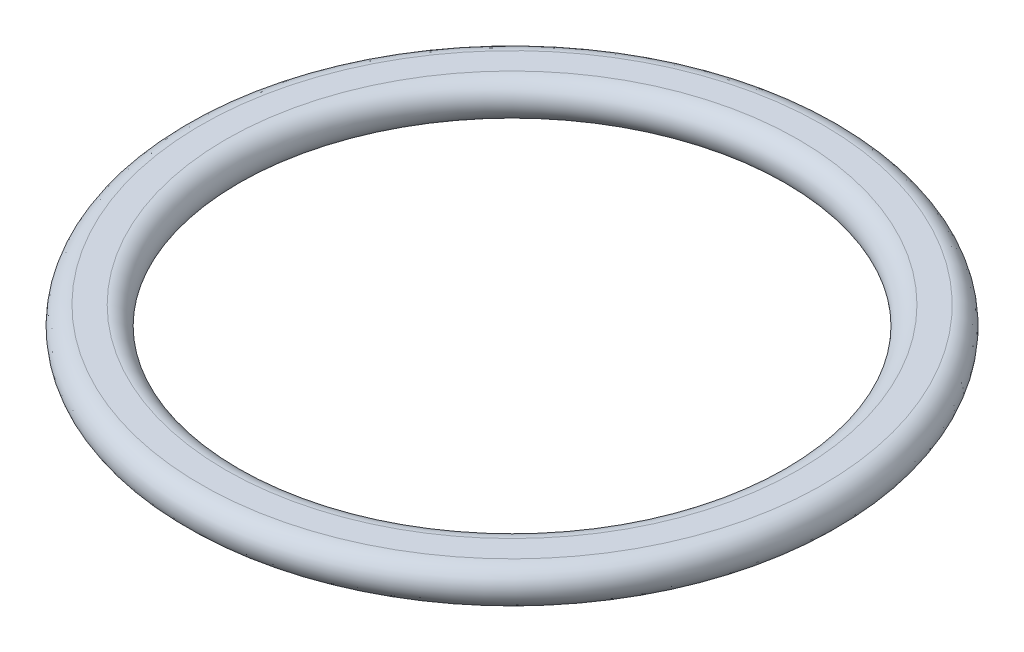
from build123d import *


with BuildPart() as part:
    # Esquisse1 → R_volution1 (revolve)
    with BuildSketch(Plane.XY, mode=Mode.PRIVATE) as r_volution1_sk:
        with BuildLine():
            Line((29.65, -1.9), (32.23, -1.9))
            add(Edge.make_bspline(
                [(32.23, 1.9), (32.442655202, 1.9), (32.658243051, 1.863284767), (32.858910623, 1.792894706), (33.059578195, 1.722504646), (33.250860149, 1.616498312), (33.416916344, 1.483654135), (33.582972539, 1.350809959), (33.728383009, 1.187463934), (33.84110625, 1.007142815), (33.953829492, 0.826821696), (34.036974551, 0.624552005), (34.083656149, 0.417083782), (34.130337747, 0.209615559), (34.14184342, -0.008773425), (34.117220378, -0.219998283), (34.092597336, -0.431223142), (34.031166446, -0.641109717), (33.938014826, -0.832277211), (33.844863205, -1.023444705), (33.717421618, -1.201165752), (33.566243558, -1.350723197), (33.415065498, -1.500280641), (33.235981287, -1.625799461), (33.043820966, -1.716885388), (32.851660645, -1.807971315), (32.641124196, -1.867136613), (32.429646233, -1.889481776), (32.363374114, -1.896484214), (32.296641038, -1.9), (32.23, -1.9)],
                knots=[0, 0, 0, 0, 0.000637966, 0.000637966, 0.000637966, 0.001275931, 0.001275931, 0.001275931, 0.001913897, 0.001913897, 0.001913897, 0.002551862, 0.002551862, 0.002551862, 0.003189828, 0.003189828, 0.003189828, 0.003827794, 0.003827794, 0.003827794, 0.004465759, 0.004465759, 0.004465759, 0.005103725, 0.005103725, 0.005103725, 0.00574169, 0.00574169, 0.00574169, 0.005939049, 0.005939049, 0.005939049, 0.005939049], degree=3))
            Line((32.23, 1.9), (29.65, 1.9))
            ThreePointArc((29.65, 1.9), (27.75, 0), (29.65, -1.9))
        make_face()
    revolve(r_volution1_sk.sketch.rotate(Axis((0, 2.007130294, 0), (0, -1, 0)), 270), axis=Axis((0, 2.007130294, 0), (0, -1, 0)))


solid = part.part
